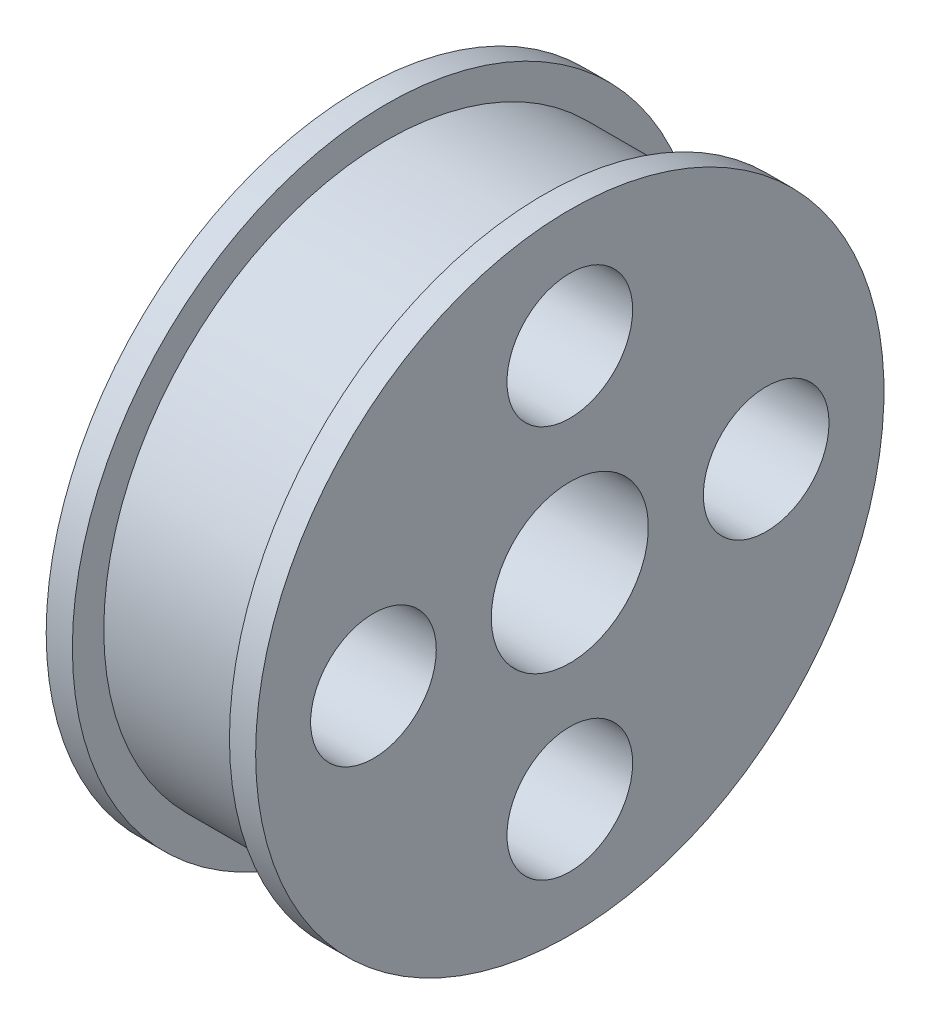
ISO-10303-21;
HEADER;
FILE_DESCRIPTION(('STEP AP214'),'2;1');
FILE_NAME('part.step','',(''),(''),'','','');
FILE_SCHEMA(('AUTOMOTIVE_DESIGN { 1 0 10303 214 1 1 1 1 }'));
ENDSEC;
DATA;
#1=APPLICATION_CONTEXT('core data for automotive mechanical design processes');
#2=APPLICATION_PROTOCOL_DEFINITION('international standard','automotive_design',2000,#1);
#3=PRODUCT_CONTEXT('',#1,'mechanical');
#4=PRODUCT('Part','Part','',(#3));
#5=PRODUCT_RELATED_PRODUCT_CATEGORY('part','',(#4));
#6=PRODUCT_DEFINITION_FORMATION('','',#4);
#7=PRODUCT_DEFINITION_CONTEXT('part definition',#1,'design');
#8=PRODUCT_DEFINITION('design','',#6,#7);
#9=PRODUCT_DEFINITION_SHAPE('','',#8);
#10=(LENGTH_UNIT() NAMED_UNIT(*) SI_UNIT(.MILLI.,.METRE.));
#11=(NAMED_UNIT(*) PLANE_ANGLE_UNIT() SI_UNIT($,.RADIAN.));
#12=(NAMED_UNIT(*) SI_UNIT($,.STERADIAN.) SOLID_ANGLE_UNIT());
#13=UNCERTAINTY_MEASURE_WITH_UNIT(LENGTH_MEASURE(1.E-05),#10,'distance_accuracy_value','');
#14=(GEOMETRIC_REPRESENTATION_CONTEXT(3) GLOBAL_UNCERTAINTY_ASSIGNED_CONTEXT((#13)) GLOBAL_UNIT_ASSIGNED_CONTEXT((#10,
#11,#12)) REPRESENTATION_CONTEXT('',''));
#15=CARTESIAN_POINT('',(0.,0.,0.));
#16=DIRECTION('',(0.,0.,1.));
#17=DIRECTION('',(1.,0.,0.));
#18=AXIS2_PLACEMENT_3D('',#15,#16,#17);
#19=CARTESIAN_POINT('',(0.,15.,0.));
#20=DIRECTION('',(1.,0.,0.));
#21=DIRECTION('',(0.,0.,-1.));
#22=AXIS2_PLACEMENT_3D('',#19,#20,#21);
#23=PLANE('',#22);
#24=CARTESIAN_POINT('',(0.,3.92791878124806E-13,37.5));
#25=DIRECTION('',(1.,0.,0.));
#26=DIRECTION('',(0.,0.,-1.));
#27=AXIS2_PLACEMENT_3D('',#24,#25,#26);
#28=CIRCLE('',#27,12.);
#29=CARTESIAN_POINT('',(0.,3.92791878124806E-13,25.5));
#30=VERTEX_POINT('',#29);
#31=EDGE_CURVE('E77',#30,#30,#28,.T.);
#32=ORIENTED_EDGE('',*,*,#31,.T.);
#33=EDGE_LOOP('',(#32));
#34=FACE_BOUND('',#33,.T.);
#35=CARTESIAN_POINT('',(0.,-37.5,2.61861252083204E-13));
#36=DIRECTION('',(1.,0.,0.));
#37=DIRECTION('',(0.,0.,-1.));
#38=AXIS2_PLACEMENT_3D('',#35,#36,#37);
#39=CIRCLE('',#38,12.);
#40=CARTESIAN_POINT('',(0.,-37.5,-11.9999999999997));
#41=VERTEX_POINT('',#40);
#42=EDGE_CURVE('E71',#41,#41,#39,.T.);
#43=ORIENTED_EDGE('',*,*,#42,.T.);
#44=EDGE_LOOP('',(#43));
#45=FACE_BOUND('',#44,.T.);
#46=CARTESIAN_POINT('',(0.,-1.30930626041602E-13,-37.5));
#47=DIRECTION('',(1.,0.,0.));
#48=DIRECTION('',(0.,0.,-1.));
#49=AXIS2_PLACEMENT_3D('',#46,#47,#48);
#50=CIRCLE('',#49,12.);
#51=CARTESIAN_POINT('',(0.,-1.30930626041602E-13,-49.5));
#52=VERTEX_POINT('',#51);
#53=EDGE_CURVE('E65',#52,#52,#50,.T.);
#54=ORIENTED_EDGE('',*,*,#53,.T.);
#55=EDGE_LOOP('',(#54));
#56=FACE_BOUND('',#55,.T.);
#57=CARTESIAN_POINT('',(0.,37.5,0.));
#58=DIRECTION('',(1.,0.,0.));
#59=DIRECTION('',(0.,0.,-1.));
#60=AXIS2_PLACEMENT_3D('',#57,#58,#59);
#61=CIRCLE('',#60,12.);
#62=CARTESIAN_POINT('',(0.,37.5,-12.));
#63=VERTEX_POINT('',#62);
#64=EDGE_CURVE('E59',#63,#63,#61,.T.);
#65=ORIENTED_EDGE('',*,*,#64,.T.);
#66=EDGE_LOOP('',(#65));
#67=FACE_BOUND('',#66,.T.);
#68=CARTESIAN_POINT('',(0.,0.,0.));
#69=DIRECTION('',(-1.,0.,0.));
#70=DIRECTION('',(0.,0.,1.));
#71=AXIS2_PLACEMENT_3D('',#68,#69,#70);
#72=CIRCLE('',#71,15.);
#73=CARTESIAN_POINT('',(0.,0.,15.));
#74=VERTEX_POINT('',#73);
#75=EDGE_CURVE('E56',#74,#74,#72,.T.);
#76=ORIENTED_EDGE('',*,*,#75,.F.);
#77=EDGE_LOOP('',(#76));
#78=FACE_BOUND('',#77,.T.);
#79=CARTESIAN_POINT('',(0.,0.,0.));
#80=DIRECTION('',(-1.,0.,0.));
#81=DIRECTION('',(0.,0.,1.));
#82=AXIS2_PLACEMENT_3D('',#79,#80,#81);
#83=CIRCLE('',#82,60.);
#84=CARTESIAN_POINT('',(0.,0.,60.));
#85=VERTEX_POINT('',#84);
#86=EDGE_CURVE('E10',#85,#85,#83,.T.);
#87=ORIENTED_EDGE('',*,*,#86,.T.);
#88=EDGE_LOOP('',(#87));
#89=FACE_BOUND('',#88,.T.);
#90=ADVANCED_FACE('F28',(#34,#45,#56,#67,#78,#89),#23,.F.);
#91=CARTESIAN_POINT('',(0.,0.,0.));
#92=DIRECTION('',(-1.,0.,0.));
#93=DIRECTION('',(0.,0.,1.));
#94=AXIS2_PLACEMENT_3D('',#91,#92,#93);
#95=CYLINDRICAL_SURFACE('',#94,60.);
#96=ORIENTED_EDGE('',*,*,#86,.F.);
#97=EDGE_LOOP('',(#96));
#98=FACE_BOUND('',#97,.T.);
#99=CARTESIAN_POINT('',(5.,0.,0.));
#100=DIRECTION('',(-1.,0.,0.));
#101=DIRECTION('',(0.,0.,1.));
#102=AXIS2_PLACEMENT_3D('',#99,#100,#101);
#103=CIRCLE('',#102,60.);
#104=CARTESIAN_POINT('',(5.,0.,60.));
#105=VERTEX_POINT('',#104);
#106=EDGE_CURVE('E34',#105,#105,#103,.T.);
#107=ORIENTED_EDGE('',*,*,#106,.T.);
#108=EDGE_LOOP('',(#107));
#109=FACE_BOUND('',#108,.T.);
#110=ADVANCED_FACE('F109',(#98,#109),#95,.T.);
#111=CARTESIAN_POINT('',(5.,54.,0.));
#112=DIRECTION('',(-1.,0.,0.));
#113=DIRECTION('',(0.,0.,1.));
#114=AXIS2_PLACEMENT_3D('',#111,#112,#113);
#115=PLANE('',#114);
#116=ORIENTED_EDGE('',*,*,#106,.F.);
#117=EDGE_LOOP('',(#116));
#118=FACE_BOUND('',#117,.T.);
#119=CARTESIAN_POINT('',(5.,0.,0.));
#120=DIRECTION('',(-1.,0.,0.));
#121=DIRECTION('',(0.,0.,1.));
#122=AXIS2_PLACEMENT_3D('',#119,#120,#121);
#123=CIRCLE('',#122,54.);
#124=CARTESIAN_POINT('',(5.,0.,54.));
#125=VERTEX_POINT('',#124);
#126=EDGE_CURVE('E38',#125,#125,#123,.T.);
#127=ORIENTED_EDGE('',*,*,#126,.T.);
#128=EDGE_LOOP('',(#127));
#129=FACE_BOUND('',#128,.T.);
#130=ADVANCED_FACE('F114',(#118,#129),#115,.F.);
#131=CARTESIAN_POINT('',(0.,0.,0.));
#132=DIRECTION('',(-1.,0.,0.));
#133=DIRECTION('',(0.,0.,1.));
#134=AXIS2_PLACEMENT_3D('',#131,#132,#133);
#135=CYLINDRICAL_SURFACE('',#134,54.);
#136=ORIENTED_EDGE('',*,*,#126,.F.);
#137=EDGE_LOOP('',(#136));
#138=FACE_BOUND('',#137,.T.);
#139=CARTESIAN_POINT('',(35.,0.,0.));
#140=DIRECTION('',(-1.,0.,0.));
#141=DIRECTION('',(0.,0.,1.));
#142=AXIS2_PLACEMENT_3D('',#139,#140,#141);
#143=CIRCLE('',#142,54.);
#144=CARTESIAN_POINT('',(35.,0.,54.));
#145=VERTEX_POINT('',#144);
#146=EDGE_CURVE('E42',#145,#145,#143,.T.);
#147=ORIENTED_EDGE('',*,*,#146,.T.);
#148=EDGE_LOOP('',(#147));
#149=FACE_BOUND('',#148,.T.);
#150=ADVANCED_FACE('F142',(#138,#149),#135,.T.);
#151=CARTESIAN_POINT('',(35.,60.,0.));
#152=DIRECTION('',(1.,0.,0.));
#153=DIRECTION('',(0.,0.,-1.));
#154=AXIS2_PLACEMENT_3D('',#151,#152,#153);
#155=PLANE('',#154);
#156=ORIENTED_EDGE('',*,*,#146,.F.);
#157=EDGE_LOOP('',(#156));
#158=FACE_BOUND('',#157,.T.);
#159=CARTESIAN_POINT('',(35.,0.,0.));
#160=DIRECTION('',(-1.,0.,0.));
#161=DIRECTION('',(0.,0.,1.));
#162=AXIS2_PLACEMENT_3D('',#159,#160,#161);
#163=CIRCLE('',#162,60.);
#164=CARTESIAN_POINT('',(35.,0.,60.));
#165=VERTEX_POINT('',#164);
#166=EDGE_CURVE('E47',#165,#165,#163,.T.);
#167=ORIENTED_EDGE('',*,*,#166,.T.);
#168=EDGE_LOOP('',(#167));
#169=FACE_BOUND('',#168,.T.);
#170=ADVANCED_FACE('F138',(#158,#169),#155,.F.);
#171=CARTESIAN_POINT('',(0.,0.,0.));
#172=DIRECTION('',(-1.,0.,0.));
#173=DIRECTION('',(0.,0.,1.));
#174=AXIS2_PLACEMENT_3D('',#171,#172,#173);
#175=CYLINDRICAL_SURFACE('',#174,60.);
#176=ORIENTED_EDGE('',*,*,#166,.F.);
#177=EDGE_LOOP('',(#176));
#178=FACE_BOUND('',#177,.T.);
#179=CARTESIAN_POINT('',(40.,0.,0.));
#180=DIRECTION('',(-1.,0.,0.));
#181=DIRECTION('',(0.,0.,1.));
#182=AXIS2_PLACEMENT_3D('',#179,#180,#181);
#183=CIRCLE('',#182,60.);
#184=CARTESIAN_POINT('',(40.,0.,60.));
#185=VERTEX_POINT('',#184);
#186=EDGE_CURVE('E50',#185,#185,#183,.T.);
#187=ORIENTED_EDGE('',*,*,#186,.T.);
#188=EDGE_LOOP('',(#187));
#189=FACE_BOUND('',#188,.T.);
#190=ADVANCED_FACE('F90',(#178,#189),#175,.T.);
#191=CARTESIAN_POINT('',(40.,60.,0.));
#192=DIRECTION('',(-1.,0.,0.));
#193=DIRECTION('',(0.,0.,1.));
#194=AXIS2_PLACEMENT_3D('',#191,#192,#193);
#195=PLANE('',#194);
#196=CARTESIAN_POINT('',(40.,3.92791878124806E-13,37.5));
#197=DIRECTION('',(1.,0.,0.));
#198=DIRECTION('',(0.,0.,-1.));
#199=AXIS2_PLACEMENT_3D('',#196,#197,#198);
#200=CIRCLE('',#199,12.);
#201=CARTESIAN_POINT('',(40.,3.92791878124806E-13,25.5));
#202=VERTEX_POINT('',#201);
#203=EDGE_CURVE('E80',#202,#202,#200,.T.);
#204=ORIENTED_EDGE('',*,*,#203,.F.);
#205=EDGE_LOOP('',(#204));
#206=FACE_BOUND('',#205,.T.);
#207=CARTESIAN_POINT('',(40.,-37.5,2.61861252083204E-13));
#208=DIRECTION('',(1.,0.,0.));
#209=DIRECTION('',(0.,0.,-1.));
#210=AXIS2_PLACEMENT_3D('',#207,#208,#209);
#211=CIRCLE('',#210,12.);
#212=CARTESIAN_POINT('',(40.,-37.5,-11.9999999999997));
#213=VERTEX_POINT('',#212);
#214=EDGE_CURVE('E74',#213,#213,#211,.T.);
#215=ORIENTED_EDGE('',*,*,#214,.F.);
#216=EDGE_LOOP('',(#215));
#217=FACE_BOUND('',#216,.T.);
#218=CARTESIAN_POINT('',(40.,-1.30930626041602E-13,-37.5));
#219=DIRECTION('',(1.,0.,0.));
#220=DIRECTION('',(0.,0.,-1.));
#221=AXIS2_PLACEMENT_3D('',#218,#219,#220);
#222=CIRCLE('',#221,12.);
#223=CARTESIAN_POINT('',(40.,-1.30930626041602E-13,-49.5));
#224=VERTEX_POINT('',#223);
#225=EDGE_CURVE('E68',#224,#224,#222,.T.);
#226=ORIENTED_EDGE('',*,*,#225,.F.);
#227=EDGE_LOOP('',(#226));
#228=FACE_BOUND('',#227,.T.);
#229=CARTESIAN_POINT('',(40.,37.5,0.));
#230=DIRECTION('',(1.,0.,0.));
#231=DIRECTION('',(0.,0.,-1.));
#232=AXIS2_PLACEMENT_3D('',#229,#230,#231);
#233=CIRCLE('',#232,12.);
#234=CARTESIAN_POINT('',(40.,37.5,-12.));
#235=VERTEX_POINT('',#234);
#236=EDGE_CURVE('E62',#235,#235,#233,.T.);
#237=ORIENTED_EDGE('',*,*,#236,.F.);
#238=EDGE_LOOP('',(#237));
#239=FACE_BOUND('',#238,.T.);
#240=ORIENTED_EDGE('',*,*,#186,.F.);
#241=EDGE_LOOP('',(#240));
#242=FACE_BOUND('',#241,.T.);
#243=CARTESIAN_POINT('',(40.,0.,0.));
#244=DIRECTION('',(-1.,0.,0.));
#245=DIRECTION('',(0.,0.,1.));
#246=AXIS2_PLACEMENT_3D('',#243,#244,#245);
#247=CIRCLE('',#246,15.);
#248=CARTESIAN_POINT('',(40.,0.,15.));
#249=VERTEX_POINT('',#248);
#250=EDGE_CURVE('E53',#249,#249,#247,.T.);
#251=ORIENTED_EDGE('',*,*,#250,.T.);
#252=EDGE_LOOP('',(#251));
#253=FACE_BOUND('',#252,.T.);
#254=ADVANCED_FACE('F86',(#206,#217,#228,#239,#242,#253),#195,.F.);
#255=CARTESIAN_POINT('',(0.,0.,0.));
#256=DIRECTION('',(-1.,0.,0.));
#257=DIRECTION('',(0.,0.,1.));
#258=AXIS2_PLACEMENT_3D('',#255,#256,#257);
#259=CYLINDRICAL_SURFACE('',#258,15.);
#260=ORIENTED_EDGE('',*,*,#250,.F.);
#261=EDGE_LOOP('',(#260));
#262=FACE_BOUND('',#261,.T.);
#263=ORIENTED_EDGE('',*,*,#75,.T.);
#264=EDGE_LOOP('',(#263));
#265=FACE_BOUND('',#264,.T.);
#266=ADVANCED_FACE('F89',(#262,#265),#259,.F.);
#267=CARTESIAN_POINT('',(0.,37.5,0.));
#268=DIRECTION('',(1.,0.,0.));
#269=DIRECTION('',(0.,0.,-1.));
#270=AXIS2_PLACEMENT_3D('',#267,#268,#269);
#271=CYLINDRICAL_SURFACE('',#270,12.);
#272=ORIENTED_EDGE('',*,*,#64,.F.);
#273=EDGE_LOOP('',(#272));
#274=FACE_BOUND('',#273,.T.);
#275=ORIENTED_EDGE('',*,*,#236,.T.);
#276=EDGE_LOOP('',(#275));
#277=FACE_BOUND('',#276,.T.);
#278=ADVANCED_FACE('F104',(#274,#277),#271,.F.);
#279=CARTESIAN_POINT('',(0.,-1.30930626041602E-13,-37.5));
#280=DIRECTION('',(1.,0.,0.));
#281=DIRECTION('',(0.,0.,-1.));
#282=AXIS2_PLACEMENT_3D('',#279,#280,#281);
#283=CYLINDRICAL_SURFACE('',#282,12.);
#284=ORIENTED_EDGE('',*,*,#53,.F.);
#285=EDGE_LOOP('',(#284));
#286=FACE_BOUND('',#285,.T.);
#287=ORIENTED_EDGE('',*,*,#225,.T.);
#288=EDGE_LOOP('',(#287));
#289=FACE_BOUND('',#288,.T.);
#290=ADVANCED_FACE('F126',(#286,#289),#283,.F.);
#291=CARTESIAN_POINT('',(0.,-37.5,2.61861252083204E-13));
#292=DIRECTION('',(1.,0.,0.));
#293=DIRECTION('',(0.,0.,-1.));
#294=AXIS2_PLACEMENT_3D('',#291,#292,#293);
#295=CYLINDRICAL_SURFACE('',#294,12.);
#296=ORIENTED_EDGE('',*,*,#42,.F.);
#297=EDGE_LOOP('',(#296));
#298=FACE_BOUND('',#297,.T.);
#299=ORIENTED_EDGE('',*,*,#214,.T.);
#300=EDGE_LOOP('',(#299));
#301=FACE_BOUND('',#300,.T.);
#302=ADVANCED_FACE('F131',(#298,#301),#295,.F.);
#303=CARTESIAN_POINT('',(0.,3.92791878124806E-13,37.5));
#304=DIRECTION('',(1.,0.,0.));
#305=DIRECTION('',(0.,0.,-1.));
#306=AXIS2_PLACEMENT_3D('',#303,#304,#305);
#307=CYLINDRICAL_SURFACE('',#306,12.);
#308=ORIENTED_EDGE('',*,*,#31,.F.);
#309=EDGE_LOOP('',(#308));
#310=FACE_BOUND('',#309,.T.);
#311=ORIENTED_EDGE('',*,*,#203,.T.);
#312=EDGE_LOOP('',(#311));
#313=FACE_BOUND('',#312,.T.);
#314=ADVANCED_FACE('F84',(#310,#313),#307,.F.);
#315=CLOSED_SHELL('',(#90,#110,#130,#150,#170,#190,#254,#266,#278,#290,#302,#314));
#316=MANIFOLD_SOLID_BREP('B2',#315);
#317=ADVANCED_BREP_SHAPE_REPRESENTATION('',(#18,#316),#14);
#318=SHAPE_DEFINITION_REPRESENTATION(#9,#317);
ENDSEC;
END-ISO-10303-21;
